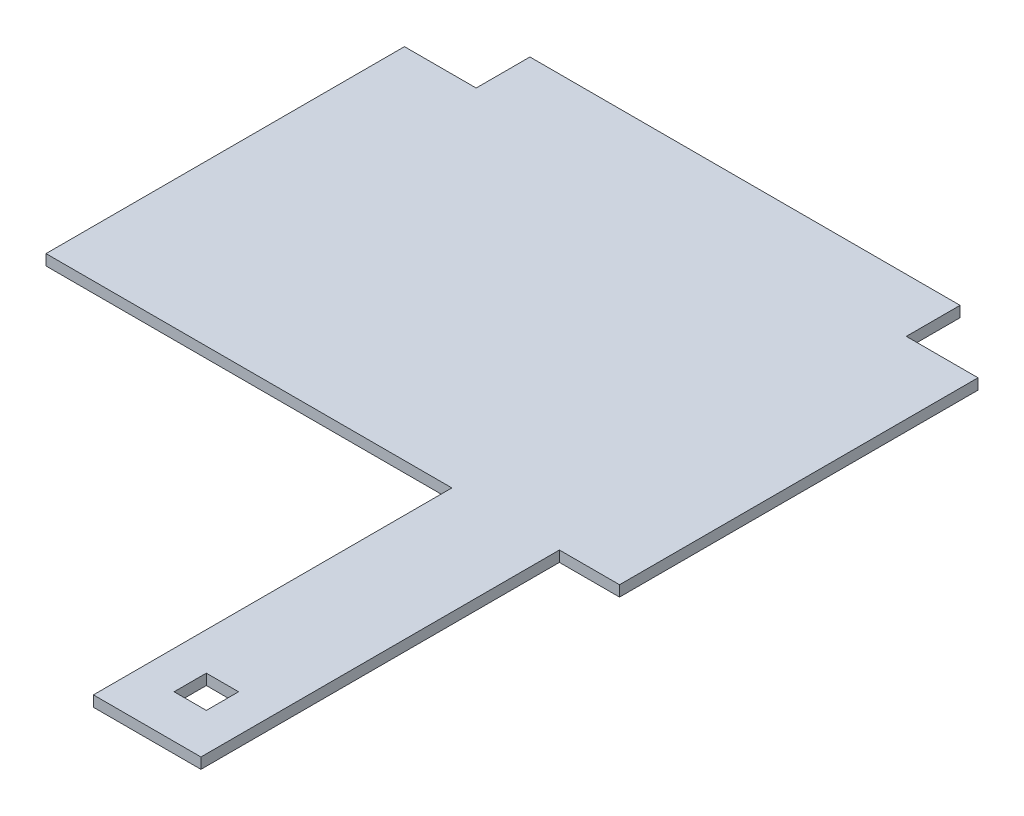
ISO-10303-21;
HEADER;
FILE_DESCRIPTION(('STEP AP214'),'2;1');
FILE_NAME('part.step','',(''),(''),'','','');
FILE_SCHEMA(('AUTOMOTIVE_DESIGN { 1 0 10303 214 1 1 1 1 }'));
ENDSEC;
DATA;
#1=APPLICATION_CONTEXT('core data for automotive mechanical design processes');
#2=APPLICATION_PROTOCOL_DEFINITION('international standard','automotive_design',2000,#1);
#3=PRODUCT_CONTEXT('',#1,'mechanical');
#4=PRODUCT('Part','Part','',(#3));
#5=PRODUCT_RELATED_PRODUCT_CATEGORY('part','',(#4));
#6=PRODUCT_DEFINITION_FORMATION('','',#4);
#7=PRODUCT_DEFINITION_CONTEXT('part definition',#1,'design');
#8=PRODUCT_DEFINITION('design','',#6,#7);
#9=PRODUCT_DEFINITION_SHAPE('','',#8);
#10=(LENGTH_UNIT() NAMED_UNIT(*) SI_UNIT(.MILLI.,.METRE.));
#11=(NAMED_UNIT(*) PLANE_ANGLE_UNIT() SI_UNIT($,.RADIAN.));
#12=(NAMED_UNIT(*) SI_UNIT($,.STERADIAN.) SOLID_ANGLE_UNIT());
#13=UNCERTAINTY_MEASURE_WITH_UNIT(LENGTH_MEASURE(1.E-05),#10,'distance_accuracy_value','');
#14=(GEOMETRIC_REPRESENTATION_CONTEXT(3) GLOBAL_UNCERTAINTY_ASSIGNED_CONTEXT((#13)) GLOBAL_UNIT_ASSIGNED_CONTEXT((#10,
#11,#12)) REPRESENTATION_CONTEXT('',''));
#15=CARTESIAN_POINT('',(0.,0.,0.));
#16=DIRECTION('',(0.,0.,1.));
#17=DIRECTION('',(1.,0.,0.));
#18=AXIS2_PLACEMENT_3D('',#15,#16,#17);
#19=CARTESIAN_POINT('',(0.,3.,0.));
#20=DIRECTION('',(0.,-1.,0.));
#21=DIRECTION('',(0.,0.,-1.));
#22=AXIS2_PLACEMENT_3D('',#19,#20,#21);
#23=PLANE('',#22);
#24=DIRECTION('',(1.,0.,0.));
#25=VECTOR('',#24,1.);
#26=CARTESIAN_POINT('',(63.2260358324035,3.,50.));
#27=LINE('',#26,#25);
#28=CARTESIAN_POINT('',(63.2260358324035,3.,50.));
#29=VERTEX_POINT('',#28);
#30=CARTESIAN_POINT('',(80.,3.,50.));
#31=VERTEX_POINT('',#30);
#32=EDGE_CURVE('E184',#29,#31,#27,.T.);
#33=ORIENTED_EDGE('',*,*,#32,.T.);
#34=DIRECTION('',(0.,0.,-1.));
#35=VECTOR('',#34,1.);
#36=CARTESIAN_POINT('',(80.,3.,-50.));
#37=LINE('',#36,#35);
#38=CARTESIAN_POINT('',(80.,3.,-50.));
#39=VERTEX_POINT('',#38);
#40=EDGE_CURVE('E187',#31,#39,#37,.T.);
#41=ORIENTED_EDGE('',*,*,#40,.T.);
#42=DIRECTION('',(-1.,0.,0.));
#43=VECTOR('',#42,1.);
#44=CARTESIAN_POINT('',(60.,3.,-50.));
#45=LINE('',#44,#43);
#46=CARTESIAN_POINT('',(60.,3.,-50.));
#47=VERTEX_POINT('',#46);
#48=EDGE_CURVE('E190',#39,#47,#45,.T.);
#49=ORIENTED_EDGE('',*,*,#48,.T.);
#50=DIRECTION('',(0.,0.,-1.));
#51=VECTOR('',#50,1.);
#52=CARTESIAN_POINT('',(60.,3.,-50.));
#53=LINE('',#52,#51);
#54=CARTESIAN_POINT('',(60.,3.,-65.0000000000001));
#55=VERTEX_POINT('',#54);
#56=EDGE_CURVE('E192',#47,#55,#53,.T.);
#57=ORIENTED_EDGE('',*,*,#56,.T.);
#58=DIRECTION('',(-1.,0.,0.));
#59=VECTOR('',#58,1.);
#60=CARTESIAN_POINT('',(-60.,3.,-65.));
#61=LINE('',#60,#59);
#62=CARTESIAN_POINT('',(-60.,3.,-65.));
#63=VERTEX_POINT('',#62);
#64=EDGE_CURVE('E194',#55,#63,#61,.T.);
#65=ORIENTED_EDGE('',*,*,#64,.T.);
#66=DIRECTION('',(0.,0.,1.));
#67=VECTOR('',#66,1.);
#68=CARTESIAN_POINT('',(-60.,3.,-50.));
#69=LINE('',#68,#67);
#70=CARTESIAN_POINT('',(-60.,3.,-50.));
#71=VERTEX_POINT('',#70);
#72=EDGE_CURVE('E196',#63,#71,#69,.T.);
#73=ORIENTED_EDGE('',*,*,#72,.T.);
#74=DIRECTION('',(-1.,0.,0.));
#75=VECTOR('',#74,1.);
#76=CARTESIAN_POINT('',(-80.,3.,-50.));
#77=LINE('',#76,#75);
#78=CARTESIAN_POINT('',(-80.,3.,-50.));
#79=VERTEX_POINT('',#78);
#80=EDGE_CURVE('E198',#71,#79,#77,.T.);
#81=ORIENTED_EDGE('',*,*,#80,.T.);
#82=DIRECTION('',(0.,0.,1.));
#83=VECTOR('',#82,1.);
#84=CARTESIAN_POINT('',(-80.,3.,-50.));
#85=LINE('',#84,#83);
#86=CARTESIAN_POINT('',(-80.,3.,50.));
#87=VERTEX_POINT('',#86);
#88=EDGE_CURVE('E200',#79,#87,#85,.T.);
#89=ORIENTED_EDGE('',*,*,#88,.T.);
#90=DIRECTION('',(1.,0.,0.));
#91=VECTOR('',#90,1.);
#92=CARTESIAN_POINT('',(-80.,3.,50.));
#93=LINE('',#92,#91);
#94=CARTESIAN_POINT('',(33.2260358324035,3.,50.));
#95=VERTEX_POINT('',#94);
#96=EDGE_CURVE('E202',#87,#95,#93,.T.);
#97=ORIENTED_EDGE('',*,*,#96,.T.);
#98=DIRECTION('',(0.,0.,1.));
#99=VECTOR('',#98,1.);
#100=CARTESIAN_POINT('',(33.2260358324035,3.,50.));
#101=LINE('',#100,#99);
#102=CARTESIAN_POINT('',(33.2260358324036,3.,150.));
#103=VERTEX_POINT('',#102);
#104=EDGE_CURVE('E204',#95,#103,#101,.T.);
#105=ORIENTED_EDGE('',*,*,#104,.T.);
#106=DIRECTION('',(1.,0.,0.));
#107=VECTOR('',#106,1.);
#108=CARTESIAN_POINT('',(33.2260358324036,3.,150.));
#109=LINE('',#108,#107);
#110=CARTESIAN_POINT('',(63.2260358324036,3.,150.));
#111=VERTEX_POINT('',#110);
#112=EDGE_CURVE('E206',#103,#111,#109,.T.);
#113=ORIENTED_EDGE('',*,*,#112,.T.);
#114=DIRECTION('',(0.,0.,-1.));
#115=VECTOR('',#114,1.);
#116=CARTESIAN_POINT('',(63.2260358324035,3.,50.));
#117=LINE('',#116,#115);
#118=EDGE_CURVE('E208',#111,#29,#117,.T.);
#119=ORIENTED_EDGE('',*,*,#118,.T.);
#120=EDGE_LOOP('',(#33,#41,#49,#57,#65,#73,#81,#89,#97,#105,#113,#119));
#121=FACE_BOUND('',#120,.T.);
#122=DIRECTION('',(0.,0.,-1.));
#123=VECTOR('',#122,1.);
#124=CARTESIAN_POINT('',(52.7260358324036,3.,129.));
#125=LINE('',#124,#123);
#126=CARTESIAN_POINT('',(52.7260358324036,3.,138.));
#127=VERTEX_POINT('',#126);
#128=CARTESIAN_POINT('',(52.7260358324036,3.,129.));
#129=VERTEX_POINT('',#128);
#130=EDGE_CURVE('E148',#127,#129,#125,.T.);
#131=ORIENTED_EDGE('',*,*,#130,.F.);
#132=DIRECTION('',(1.,0.,0.));
#133=VECTOR('',#132,1.);
#134=CARTESIAN_POINT('',(43.7260358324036,3.,138.));
#135=LINE('',#134,#133);
#136=CARTESIAN_POINT('',(43.7260358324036,3.,138.));
#137=VERTEX_POINT('',#136);
#138=EDGE_CURVE('E170',#137,#127,#135,.T.);
#139=ORIENTED_EDGE('',*,*,#138,.F.);
#140=DIRECTION('',(0.,0.,1.));
#141=VECTOR('',#140,1.);
#142=CARTESIAN_POINT('',(43.7260358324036,3.,129.));
#143=LINE('',#142,#141);
#144=CARTESIAN_POINT('',(43.7260358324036,3.,129.));
#145=VERTEX_POINT('',#144);
#146=EDGE_CURVE('E168',#145,#137,#143,.T.);
#147=ORIENTED_EDGE('',*,*,#146,.F.);
#148=DIRECTION('',(-1.,0.,0.));
#149=VECTOR('',#148,1.);
#150=CARTESIAN_POINT('',(43.7260358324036,3.,129.));
#151=LINE('',#150,#149);
#152=EDGE_CURVE('E156',#129,#145,#151,.T.);
#153=ORIENTED_EDGE('',*,*,#152,.F.);
#154=EDGE_LOOP('',(#131,#139,#147,#153));
#155=FACE_BOUND('',#154,.T.);
#156=ADVANCED_FACE('F35',(#121,#155),#23,.F.);
#157=CARTESIAN_POINT('',(0.,0.,0.));
#158=DIRECTION('',(0.,-1.,0.));
#159=DIRECTION('',(0.,0.,-1.));
#160=AXIS2_PLACEMENT_3D('',#157,#158,#159);
#161=PLANE('',#160);
#162=DIRECTION('',(1.,0.,0.));
#163=VECTOR('',#162,1.);
#164=CARTESIAN_POINT('',(63.2260358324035,0.,50.));
#165=LINE('',#164,#163);
#166=CARTESIAN_POINT('',(63.2260358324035,0.,50.));
#167=VERTEX_POINT('',#166);
#168=CARTESIAN_POINT('',(80.,0.,50.));
#169=VERTEX_POINT('',#168);
#170=EDGE_CURVE('E164',#167,#169,#165,.T.);
#171=ORIENTED_EDGE('',*,*,#170,.F.);
#172=DIRECTION('',(0.,0.,-1.));
#173=VECTOR('',#172,1.);
#174=CARTESIAN_POINT('',(63.2260358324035,0.,50.));
#175=LINE('',#174,#173);
#176=CARTESIAN_POINT('',(63.2260358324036,0.,150.));
#177=VERTEX_POINT('',#176);
#178=EDGE_CURVE('E188',#177,#167,#175,.T.);
#179=ORIENTED_EDGE('',*,*,#178,.F.);
#180=DIRECTION('',(1.,0.,0.));
#181=VECTOR('',#180,1.);
#182=CARTESIAN_POINT('',(33.2260358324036,0.,150.));
#183=LINE('',#182,#181);
#184=CARTESIAN_POINT('',(33.2260358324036,0.,150.));
#185=VERTEX_POINT('',#184);
#186=EDGE_CURVE('E231',#185,#177,#183,.T.);
#187=ORIENTED_EDGE('',*,*,#186,.F.);
#188=DIRECTION('',(0.,0.,1.));
#189=VECTOR('',#188,1.);
#190=CARTESIAN_POINT('',(33.2260358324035,0.,50.));
#191=LINE('',#190,#189);
#192=CARTESIAN_POINT('',(33.2260358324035,0.,50.));
#193=VERTEX_POINT('',#192);
#194=EDGE_CURVE('E229',#193,#185,#191,.T.);
#195=ORIENTED_EDGE('',*,*,#194,.F.);
#196=DIRECTION('',(1.,0.,0.));
#197=VECTOR('',#196,1.);
#198=CARTESIAN_POINT('',(-80.,0.,50.));
#199=LINE('',#198,#197);
#200=CARTESIAN_POINT('',(-80.,0.,50.));
#201=VERTEX_POINT('',#200);
#202=EDGE_CURVE('E227',#201,#193,#199,.T.);
#203=ORIENTED_EDGE('',*,*,#202,.F.);
#204=DIRECTION('',(0.,0.,1.));
#205=VECTOR('',#204,1.);
#206=CARTESIAN_POINT('',(-80.,0.,-50.));
#207=LINE('',#206,#205);
#208=CARTESIAN_POINT('',(-80.,0.,-50.));
#209=VERTEX_POINT('',#208);
#210=EDGE_CURVE('E225',#209,#201,#207,.T.);
#211=ORIENTED_EDGE('',*,*,#210,.F.);
#212=DIRECTION('',(-1.,0.,0.));
#213=VECTOR('',#212,1.);
#214=CARTESIAN_POINT('',(-80.,0.,-50.));
#215=LINE('',#214,#213);
#216=CARTESIAN_POINT('',(-60.,0.,-50.));
#217=VERTEX_POINT('',#216);
#218=EDGE_CURVE('E223',#217,#209,#215,.T.);
#219=ORIENTED_EDGE('',*,*,#218,.F.);
#220=DIRECTION('',(0.,0.,1.));
#221=VECTOR('',#220,1.);
#222=CARTESIAN_POINT('',(-60.,0.,-50.));
#223=LINE('',#222,#221);
#224=CARTESIAN_POINT('',(-60.,0.,-65.));
#225=VERTEX_POINT('',#224);
#226=EDGE_CURVE('E221',#225,#217,#223,.T.);
#227=ORIENTED_EDGE('',*,*,#226,.F.);
#228=DIRECTION('',(-1.,0.,0.));
#229=VECTOR('',#228,1.);
#230=CARTESIAN_POINT('',(-60.,0.,-65.));
#231=LINE('',#230,#229);
#232=CARTESIAN_POINT('',(60.,0.,-65.0000000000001));
#233=VERTEX_POINT('',#232);
#234=EDGE_CURVE('E219',#233,#225,#231,.T.);
#235=ORIENTED_EDGE('',*,*,#234,.F.);
#236=DIRECTION('',(0.,0.,-1.));
#237=VECTOR('',#236,1.);
#238=CARTESIAN_POINT('',(60.,0.,-50.));
#239=LINE('',#238,#237);
#240=CARTESIAN_POINT('',(60.,0.,-50.));
#241=VERTEX_POINT('',#240);
#242=EDGE_CURVE('E217',#241,#233,#239,.T.);
#243=ORIENTED_EDGE('',*,*,#242,.F.);
#244=DIRECTION('',(-1.,0.,0.));
#245=VECTOR('',#244,1.);
#246=CARTESIAN_POINT('',(60.,0.,-50.));
#247=LINE('',#246,#245);
#248=CARTESIAN_POINT('',(80.,0.,-50.));
#249=VERTEX_POINT('',#248);
#250=EDGE_CURVE('E215',#249,#241,#247,.T.);
#251=ORIENTED_EDGE('',*,*,#250,.F.);
#252=DIRECTION('',(0.,0.,-1.));
#253=VECTOR('',#252,1.);
#254=CARTESIAN_POINT('',(80.,0.,-50.));
#255=LINE('',#254,#253);
#256=EDGE_CURVE('E213',#169,#249,#255,.T.);
#257=ORIENTED_EDGE('',*,*,#256,.F.);
#258=EDGE_LOOP('',(#171,#179,#187,#195,#203,#211,#219,#227,#235,#243,#251,#257));
#259=FACE_BOUND('',#258,.T.);
#260=DIRECTION('',(1.,0.,0.));
#261=VECTOR('',#260,1.);
#262=CARTESIAN_POINT('',(43.7260358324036,0.,138.));
#263=LINE('',#262,#261);
#264=CARTESIAN_POINT('',(43.7260358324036,0.,138.));
#265=VERTEX_POINT('',#264);
#266=CARTESIAN_POINT('',(52.7260358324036,0.,138.));
#267=VERTEX_POINT('',#266);
#268=EDGE_CURVE('E157',#265,#267,#263,.T.);
#269=ORIENTED_EDGE('',*,*,#268,.T.);
#270=DIRECTION('',(0.,0.,-1.));
#271=VECTOR('',#270,1.);
#272=CARTESIAN_POINT('',(52.7260358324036,0.,129.));
#273=LINE('',#272,#271);
#274=CARTESIAN_POINT('',(52.7260358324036,0.,129.));
#275=VERTEX_POINT('',#274);
#276=EDGE_CURVE('E58',#267,#275,#273,.T.);
#277=ORIENTED_EDGE('',*,*,#276,.T.);
#278=DIRECTION('',(-1.,0.,0.));
#279=VECTOR('',#278,1.);
#280=CARTESIAN_POINT('',(43.7260358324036,0.,129.));
#281=LINE('',#280,#279);
#282=CARTESIAN_POINT('',(43.7260358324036,0.,129.));
#283=VERTEX_POINT('',#282);
#284=EDGE_CURVE('E163',#275,#283,#281,.T.);
#285=ORIENTED_EDGE('',*,*,#284,.T.);
#286=DIRECTION('',(0.,0.,1.));
#287=VECTOR('',#286,1.);
#288=CARTESIAN_POINT('',(43.7260358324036,0.,129.));
#289=LINE('',#288,#287);
#290=EDGE_CURVE('E176',#283,#265,#289,.T.);
#291=ORIENTED_EDGE('',*,*,#290,.T.);
#292=EDGE_LOOP('',(#269,#277,#285,#291));
#293=FACE_BOUND('',#292,.T.);
#294=ADVANCED_FACE('F273',(#259,#293),#161,.T.);
#295=CARTESIAN_POINT('',(63.2260358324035,3.,50.));
#296=DIRECTION('',(0.,0.,-1.));
#297=DIRECTION('',(-1.,0.,0.));
#298=AXIS2_PLACEMENT_3D('',#295,#296,#297);
#299=PLANE('',#298);
#300=ORIENTED_EDGE('',*,*,#170,.T.);
#301=DIRECTION('',(0.,-1.,0.));
#302=VECTOR('',#301,1.);
#303=CARTESIAN_POINT('',(80.,3.,50.));
#304=LINE('',#303,#302);
#305=EDGE_CURVE('E11',#31,#169,#304,.T.);
#306=ORIENTED_EDGE('',*,*,#305,.F.);
#307=ORIENTED_EDGE('',*,*,#32,.F.);
#308=DIRECTION('',(0.,-1.,0.));
#309=VECTOR('',#308,1.);
#310=CARTESIAN_POINT('',(63.2260358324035,3.,50.));
#311=LINE('',#310,#309);
#312=EDGE_CURVE('E210',#29,#167,#311,.T.);
#313=ORIENTED_EDGE('',*,*,#312,.T.);
#314=EDGE_LOOP('',(#300,#306,#307,#313));
#315=FACE_BOUND('',#314,.T.);
#316=ADVANCED_FACE('F37',(#315),#299,.F.);
#317=CARTESIAN_POINT('',(80.,3.,-50.));
#318=DIRECTION('',(-1.,0.,0.));
#319=DIRECTION('',(0.,0.,1.));
#320=AXIS2_PLACEMENT_3D('',#317,#318,#319);
#321=PLANE('',#320);
#322=ORIENTED_EDGE('',*,*,#256,.T.);
#323=DIRECTION('',(0.,-1.,0.));
#324=VECTOR('',#323,1.);
#325=CARTESIAN_POINT('',(80.,3.,-50.));
#326=LINE('',#325,#324);
#327=EDGE_CURVE('E43',#39,#249,#326,.T.);
#328=ORIENTED_EDGE('',*,*,#327,.F.);
#329=ORIENTED_EDGE('',*,*,#40,.F.);
#330=ORIENTED_EDGE('',*,*,#305,.T.);
#331=EDGE_LOOP('',(#322,#328,#329,#330));
#332=FACE_BOUND('',#331,.T.);
#333=ADVANCED_FACE('F290',(#332),#321,.F.);
#334=CARTESIAN_POINT('',(60.,3.,-50.));
#335=DIRECTION('',(0.,0.,1.));
#336=DIRECTION('',(1.,0.,0.));
#337=AXIS2_PLACEMENT_3D('',#334,#335,#336);
#338=PLANE('',#337);
#339=ORIENTED_EDGE('',*,*,#250,.T.);
#340=DIRECTION('',(0.,-1.,0.));
#341=VECTOR('',#340,1.);
#342=CARTESIAN_POINT('',(60.,3.,-50.));
#343=LINE('',#342,#341);
#344=EDGE_CURVE('E260',#47,#241,#343,.T.);
#345=ORIENTED_EDGE('',*,*,#344,.F.);
#346=ORIENTED_EDGE('',*,*,#48,.F.);
#347=ORIENTED_EDGE('',*,*,#327,.T.);
#348=EDGE_LOOP('',(#339,#345,#346,#347));
#349=FACE_BOUND('',#348,.T.);
#350=ADVANCED_FACE('F267',(#349),#338,.F.);
#351=CARTESIAN_POINT('',(60.,3.,-50.));
#352=DIRECTION('',(-1.,0.,0.));
#353=DIRECTION('',(0.,0.,1.));
#354=AXIS2_PLACEMENT_3D('',#351,#352,#353);
#355=PLANE('',#354);
#356=ORIENTED_EDGE('',*,*,#242,.T.);
#357=DIRECTION('',(0.,-1.,0.));
#358=VECTOR('',#357,1.);
#359=CARTESIAN_POINT('',(60.,3.,-65.0000000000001));
#360=LINE('',#359,#358);
#361=EDGE_CURVE('E257',#55,#233,#360,.T.);
#362=ORIENTED_EDGE('',*,*,#361,.F.);
#363=ORIENTED_EDGE('',*,*,#56,.F.);
#364=ORIENTED_EDGE('',*,*,#344,.T.);
#365=EDGE_LOOP('',(#356,#362,#363,#364));
#366=FACE_BOUND('',#365,.T.);
#367=ADVANCED_FACE('F279',(#366),#355,.F.);
#368=CARTESIAN_POINT('',(-60.,3.,-65.));
#369=DIRECTION('',(0.,0.,1.));
#370=DIRECTION('',(1.,0.,0.));
#371=AXIS2_PLACEMENT_3D('',#368,#369,#370);
#372=PLANE('',#371);
#373=ORIENTED_EDGE('',*,*,#234,.T.);
#374=DIRECTION('',(0.,-1.,0.));
#375=VECTOR('',#374,1.);
#376=CARTESIAN_POINT('',(-60.,3.,-65.));
#377=LINE('',#376,#375);
#378=EDGE_CURVE('E254',#63,#225,#377,.T.);
#379=ORIENTED_EDGE('',*,*,#378,.F.);
#380=ORIENTED_EDGE('',*,*,#64,.F.);
#381=ORIENTED_EDGE('',*,*,#361,.T.);
#382=EDGE_LOOP('',(#373,#379,#380,#381));
#383=FACE_BOUND('',#382,.T.);
#384=ADVANCED_FACE('F283',(#383),#372,.F.);
#385=CARTESIAN_POINT('',(-60.,3.,-50.));
#386=DIRECTION('',(1.,0.,0.));
#387=DIRECTION('',(0.,0.,-1.));
#388=AXIS2_PLACEMENT_3D('',#385,#386,#387);
#389=PLANE('',#388);
#390=ORIENTED_EDGE('',*,*,#226,.T.);
#391=DIRECTION('',(0.,-1.,0.));
#392=VECTOR('',#391,1.);
#393=CARTESIAN_POINT('',(-60.,3.,-50.));
#394=LINE('',#393,#392);
#395=EDGE_CURVE('E251',#71,#217,#394,.T.);
#396=ORIENTED_EDGE('',*,*,#395,.F.);
#397=ORIENTED_EDGE('',*,*,#72,.F.);
#398=ORIENTED_EDGE('',*,*,#378,.T.);
#399=EDGE_LOOP('',(#390,#396,#397,#398));
#400=FACE_BOUND('',#399,.T.);
#401=ADVANCED_FACE('F323',(#400),#389,.F.);
#402=CARTESIAN_POINT('',(-80.,3.,-50.));
#403=DIRECTION('',(0.,0.,1.));
#404=DIRECTION('',(1.,0.,0.));
#405=AXIS2_PLACEMENT_3D('',#402,#403,#404);
#406=PLANE('',#405);
#407=ORIENTED_EDGE('',*,*,#218,.T.);
#408=DIRECTION('',(0.,-1.,0.));
#409=VECTOR('',#408,1.);
#410=CARTESIAN_POINT('',(-80.,3.,-50.));
#411=LINE('',#410,#409);
#412=EDGE_CURVE('E248',#79,#209,#411,.T.);
#413=ORIENTED_EDGE('',*,*,#412,.F.);
#414=ORIENTED_EDGE('',*,*,#80,.F.);
#415=ORIENTED_EDGE('',*,*,#395,.T.);
#416=EDGE_LOOP('',(#407,#413,#414,#415));
#417=FACE_BOUND('',#416,.T.);
#418=ADVANCED_FACE('F321',(#417),#406,.F.);
#419=CARTESIAN_POINT('',(-80.,3.,-50.));
#420=DIRECTION('',(1.,0.,0.));
#421=DIRECTION('',(0.,0.,-1.));
#422=AXIS2_PLACEMENT_3D('',#419,#420,#421);
#423=PLANE('',#422);
#424=ORIENTED_EDGE('',*,*,#210,.T.);
#425=DIRECTION('',(0.,-1.,0.));
#426=VECTOR('',#425,1.);
#427=CARTESIAN_POINT('',(-80.,3.,50.));
#428=LINE('',#427,#426);
#429=EDGE_CURVE('E245',#87,#201,#428,.T.);
#430=ORIENTED_EDGE('',*,*,#429,.F.);
#431=ORIENTED_EDGE('',*,*,#88,.F.);
#432=ORIENTED_EDGE('',*,*,#412,.T.);
#433=EDGE_LOOP('',(#424,#430,#431,#432));
#434=FACE_BOUND('',#433,.T.);
#435=ADVANCED_FACE('F317',(#434),#423,.F.);
#436=CARTESIAN_POINT('',(-80.,3.,50.));
#437=DIRECTION('',(0.,0.,-1.));
#438=DIRECTION('',(-1.,0.,0.));
#439=AXIS2_PLACEMENT_3D('',#436,#437,#438);
#440=PLANE('',#439);
#441=ORIENTED_EDGE('',*,*,#202,.T.);
#442=DIRECTION('',(0.,-1.,0.));
#443=VECTOR('',#442,1.);
#444=CARTESIAN_POINT('',(33.2260358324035,3.,50.));
#445=LINE('',#444,#443);
#446=EDGE_CURVE('E242',#95,#193,#445,.T.);
#447=ORIENTED_EDGE('',*,*,#446,.F.);
#448=ORIENTED_EDGE('',*,*,#96,.F.);
#449=ORIENTED_EDGE('',*,*,#429,.T.);
#450=EDGE_LOOP('',(#441,#447,#448,#449));
#451=FACE_BOUND('',#450,.T.);
#452=ADVANCED_FACE('F312',(#451),#440,.F.);
#453=CARTESIAN_POINT('',(33.2260358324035,3.,50.));
#454=DIRECTION('',(1.,0.,0.));
#455=DIRECTION('',(0.,0.,-1.));
#456=AXIS2_PLACEMENT_3D('',#453,#454,#455);
#457=PLANE('',#456);
#458=ORIENTED_EDGE('',*,*,#194,.T.);
#459=DIRECTION('',(0.,-1.,0.));
#460=VECTOR('',#459,1.);
#461=CARTESIAN_POINT('',(33.2260358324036,3.,150.));
#462=LINE('',#461,#460);
#463=EDGE_CURVE('E239',#103,#185,#462,.T.);
#464=ORIENTED_EDGE('',*,*,#463,.F.);
#465=ORIENTED_EDGE('',*,*,#104,.F.);
#466=ORIENTED_EDGE('',*,*,#446,.T.);
#467=EDGE_LOOP('',(#458,#464,#465,#466));
#468=FACE_BOUND('',#467,.T.);
#469=ADVANCED_FACE('F306',(#468),#457,.F.);
#470=CARTESIAN_POINT('',(33.2260358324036,3.,150.));
#471=DIRECTION('',(0.,0.,-1.));
#472=DIRECTION('',(-1.,0.,0.));
#473=AXIS2_PLACEMENT_3D('',#470,#471,#472);
#474=PLANE('',#473);
#475=ORIENTED_EDGE('',*,*,#186,.T.);
#476=DIRECTION('',(0.,-1.,0.));
#477=VECTOR('',#476,1.);
#478=CARTESIAN_POINT('',(63.2260358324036,3.,150.));
#479=LINE('',#478,#477);
#480=EDGE_CURVE('E236',#111,#177,#479,.T.);
#481=ORIENTED_EDGE('',*,*,#480,.F.);
#482=ORIENTED_EDGE('',*,*,#112,.F.);
#483=ORIENTED_EDGE('',*,*,#463,.T.);
#484=EDGE_LOOP('',(#475,#481,#482,#483));
#485=FACE_BOUND('',#484,.T.);
#486=ADVANCED_FACE('F302',(#485),#474,.F.);
#487=CARTESIAN_POINT('',(63.2260358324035,3.,50.));
#488=DIRECTION('',(-1.,0.,0.));
#489=DIRECTION('',(0.,0.,1.));
#490=AXIS2_PLACEMENT_3D('',#487,#488,#489);
#491=PLANE('',#490);
#492=ORIENTED_EDGE('',*,*,#178,.T.);
#493=ORIENTED_EDGE('',*,*,#312,.F.);
#494=ORIENTED_EDGE('',*,*,#118,.F.);
#495=ORIENTED_EDGE('',*,*,#480,.T.);
#496=EDGE_LOOP('',(#492,#493,#494,#495));
#497=FACE_BOUND('',#496,.T.);
#498=ADVANCED_FACE('F297',(#497),#491,.F.);
#499=CARTESIAN_POINT('',(52.7260358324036,3.,129.));
#500=DIRECTION('',(-1.,0.,0.));
#501=DIRECTION('',(0.,0.,1.));
#502=AXIS2_PLACEMENT_3D('',#499,#500,#501);
#503=PLANE('',#502);
#504=ORIENTED_EDGE('',*,*,#276,.F.);
#505=DIRECTION('',(0.,-1.,0.));
#506=VECTOR('',#505,1.);
#507=CARTESIAN_POINT('',(52.7260358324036,3.,138.));
#508=LINE('',#507,#506);
#509=EDGE_CURVE('E152',#127,#267,#508,.T.);
#510=ORIENTED_EDGE('',*,*,#509,.F.);
#511=ORIENTED_EDGE('',*,*,#130,.T.);
#512=DIRECTION('',(0.,-1.,0.));
#513=VECTOR('',#512,1.);
#514=CARTESIAN_POINT('',(52.7260358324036,3.,129.));
#515=LINE('',#514,#513);
#516=EDGE_CURVE('E151',#129,#275,#515,.T.);
#517=ORIENTED_EDGE('',*,*,#516,.T.);
#518=EDGE_LOOP('',(#504,#510,#511,#517));
#519=FACE_BOUND('',#518,.T.);
#520=ADVANCED_FACE('F150',(#519),#503,.T.);
#521=CARTESIAN_POINT('',(43.7260358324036,3.,129.));
#522=DIRECTION('',(0.,0.,1.));
#523=DIRECTION('',(1.,0.,0.));
#524=AXIS2_PLACEMENT_3D('',#521,#522,#523);
#525=PLANE('',#524);
#526=ORIENTED_EDGE('',*,*,#284,.F.);
#527=ORIENTED_EDGE('',*,*,#516,.F.);
#528=ORIENTED_EDGE('',*,*,#152,.T.);
#529=DIRECTION('',(0.,-1.,0.));
#530=VECTOR('',#529,1.);
#531=CARTESIAN_POINT('',(43.7260358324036,3.,129.));
#532=LINE('',#531,#530);
#533=EDGE_CURVE('E165',#145,#283,#532,.T.);
#534=ORIENTED_EDGE('',*,*,#533,.T.);
#535=EDGE_LOOP('',(#526,#527,#528,#534));
#536=FACE_BOUND('',#535,.T.);
#537=ADVANCED_FACE('F160',(#536),#525,.T.);
#538=CARTESIAN_POINT('',(43.7260358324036,3.,129.));
#539=DIRECTION('',(1.,0.,0.));
#540=DIRECTION('',(0.,0.,-1.));
#541=AXIS2_PLACEMENT_3D('',#538,#539,#540);
#542=PLANE('',#541);
#543=ORIENTED_EDGE('',*,*,#290,.F.);
#544=ORIENTED_EDGE('',*,*,#533,.F.);
#545=ORIENTED_EDGE('',*,*,#146,.T.);
#546=DIRECTION('',(0.,-1.,0.));
#547=VECTOR('',#546,1.);
#548=CARTESIAN_POINT('',(43.7260358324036,3.,138.));
#549=LINE('',#548,#547);
#550=EDGE_CURVE('E50',#137,#265,#549,.T.);
#551=ORIENTED_EDGE('',*,*,#550,.T.);
#552=EDGE_LOOP('',(#543,#544,#545,#551));
#553=FACE_BOUND('',#552,.T.);
#554=ADVANCED_FACE('F381',(#553),#542,.T.);
#555=CARTESIAN_POINT('',(43.7260358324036,3.,138.));
#556=DIRECTION('',(0.,0.,-1.));
#557=DIRECTION('',(-1.,0.,0.));
#558=AXIS2_PLACEMENT_3D('',#555,#556,#557);
#559=PLANE('',#558);
#560=ORIENTED_EDGE('',*,*,#268,.F.);
#561=ORIENTED_EDGE('',*,*,#550,.F.);
#562=ORIENTED_EDGE('',*,*,#138,.T.);
#563=ORIENTED_EDGE('',*,*,#509,.T.);
#564=EDGE_LOOP('',(#560,#561,#562,#563));
#565=FACE_BOUND('',#564,.T.);
#566=ADVANCED_FACE('F387',(#565),#559,.T.);
#567=CLOSED_SHELL('',(#156,#294,#316,#333,#350,#367,#384,#401,#418,#435,#452,#469,#486,#498,
#520,#537,#554,#566));
#568=MANIFOLD_SOLID_BREP('B2',#567);
#569=ADVANCED_BREP_SHAPE_REPRESENTATION('',(#18,#568),#14);
#570=SHAPE_DEFINITION_REPRESENTATION(#9,#569);
ENDSEC;
END-ISO-10303-21;
